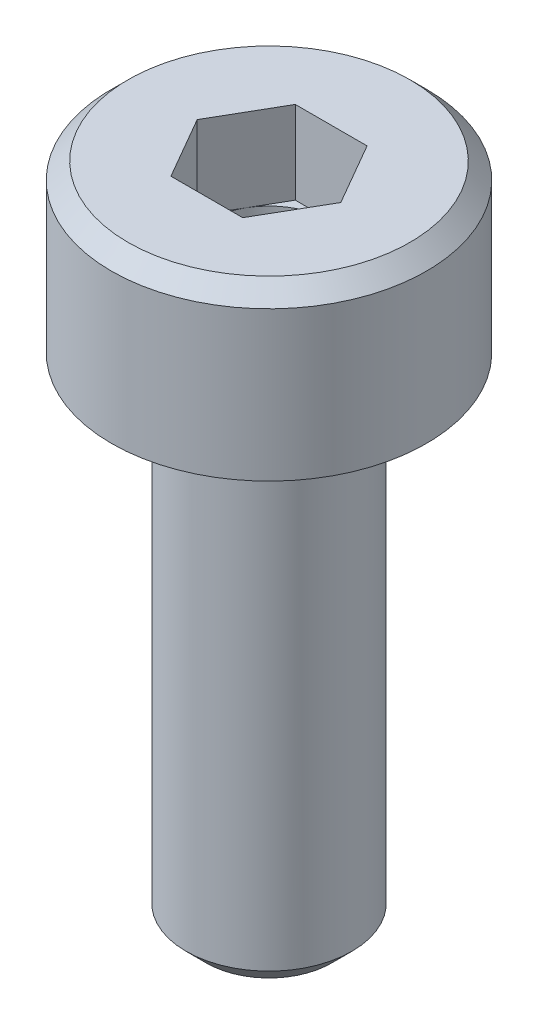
ISO-10303-21;
HEADER;
FILE_DESCRIPTION(('STEP AP214'),'2;1');
FILE_NAME('part.step','',(''),(''),'','','');
FILE_SCHEMA(('AUTOMOTIVE_DESIGN { 1 0 10303 214 1 1 1 1 }'));
ENDSEC;
DATA;
#1=APPLICATION_CONTEXT('core data for automotive mechanical design processes');
#2=APPLICATION_PROTOCOL_DEFINITION('international standard','automotive_design',2000,#1);
#3=PRODUCT_CONTEXT('',#1,'mechanical');
#4=PRODUCT('Part','Part','',(#3));
#5=PRODUCT_RELATED_PRODUCT_CATEGORY('part','',(#4));
#6=PRODUCT_DEFINITION_FORMATION('','',#4);
#7=PRODUCT_DEFINITION_CONTEXT('part definition',#1,'design');
#8=PRODUCT_DEFINITION('design','',#6,#7);
#9=PRODUCT_DEFINITION_SHAPE('','',#8);
#10=(LENGTH_UNIT() NAMED_UNIT(*) SI_UNIT(.MILLI.,.METRE.));
#11=(NAMED_UNIT(*) PLANE_ANGLE_UNIT() SI_UNIT($,.RADIAN.));
#12=(NAMED_UNIT(*) SI_UNIT($,.STERADIAN.) SOLID_ANGLE_UNIT());
#13=UNCERTAINTY_MEASURE_WITH_UNIT(LENGTH_MEASURE(1.E-05),#10,'distance_accuracy_value','');
#14=(GEOMETRIC_REPRESENTATION_CONTEXT(3) GLOBAL_UNCERTAINTY_ASSIGNED_CONTEXT((#13)) GLOBAL_UNIT_ASSIGNED_CONTEXT((#10,
#11,#12)) REPRESENTATION_CONTEXT('',''));
#15=CARTESIAN_POINT('',(0.,0.,0.));
#16=DIRECTION('',(0.,0.,1.));
#17=DIRECTION('',(1.,0.,0.));
#18=AXIS2_PLACEMENT_3D('',#15,#16,#17);
#19=CARTESIAN_POINT('',(0.,0.550000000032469,0.));
#20=DIRECTION('',(0.,1.,0.));
#21=DIRECTION('',(0.,0.,1.));
#22=AXIS2_PLACEMENT_3D('',#19,#20,#21);
#23=CONICAL_SURFACE('',#22,0.750000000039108,1.04719755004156);
#24=CARTESIAN_POINT('',(0.,0.116987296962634,0.));
#25=VERTEX_POINT('',#24);
#26=VERTEX_LOOP('',#25);
#27=FACE_BOUND('',#26,.T.);
#28=CARTESIAN_POINT('',(0.,0.55,0.));
#29=DIRECTION('',(0.,-1.,0.));
#30=DIRECTION('',(0.,0.,-1.));
#31=AXIS2_PLACEMENT_3D('',#28,#29,#30);
#32=CIRCLE('',#31,0.75);
#33=CARTESIAN_POINT('',(0.,0.55,-0.75));
#34=VERTEX_POINT('',#33);
#35=EDGE_CURVE('E98',#34,#34,#32,.F.);
#36=ORIENTED_EDGE('',*,*,#35,.T.);
#37=EDGE_LOOP('',(#36));
#38=FACE_BOUND('',#37,.T.);
#39=ADVANCED_FACE('F16',(#27,#38),#23,.F.);
#40=CARTESIAN_POINT('',(0.,2.,0.));
#41=DIRECTION('',(0.,-1.,0.));
#42=DIRECTION('',(0.,0.,-1.));
#43=AXIS2_PLACEMENT_3D('',#40,#41,#42);
#44=CYLINDRICAL_SURFACE('',#43,0.75);
#45=CARTESIAN_POINT('',(0.,1.,0.));
#46=DIRECTION('',(0.,-1.,0.));
#47=DIRECTION('',(0.,0.,-1.));
#48=AXIS2_PLACEMENT_3D('',#45,#46,#47);
#49=CIRCLE('',#48,0.75);
#50=CARTESIAN_POINT('',(0.,1.,-0.75));
#51=VERTEX_POINT('',#50);
#52=CARTESIAN_POINT('',(-0.649519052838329,1.,-0.375));
#53=VERTEX_POINT('',#52);
#54=EDGE_CURVE('E19',#51,#53,#49,.F.);
#55=ORIENTED_EDGE('',*,*,#54,.T.);
#56=CARTESIAN_POINT('',(0.,1.,0.));
#57=DIRECTION('',(0.,-1.,0.));
#58=DIRECTION('',(0.,0.,-1.));
#59=AXIS2_PLACEMENT_3D('',#56,#57,#58);
#60=CIRCLE('',#59,0.75);
#61=CARTESIAN_POINT('',(-0.649519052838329,1.,0.375));
#62=VERTEX_POINT('',#61);
#63=EDGE_CURVE('E93',#53,#62,#60,.F.);
#64=ORIENTED_EDGE('',*,*,#63,.T.);
#65=CARTESIAN_POINT('',(0.,1.,0.));
#66=DIRECTION('',(0.,-1.,0.));
#67=DIRECTION('',(0.,0.,-1.));
#68=AXIS2_PLACEMENT_3D('',#65,#66,#67);
#69=CIRCLE('',#68,0.75);
#70=CARTESIAN_POINT('',(0.,1.,0.75));
#71=VERTEX_POINT('',#70);
#72=EDGE_CURVE('E108',#62,#71,#69,.F.);
#73=ORIENTED_EDGE('',*,*,#72,.T.);
#74=CARTESIAN_POINT('',(0.,1.,0.));
#75=DIRECTION('',(0.,-1.,0.));
#76=DIRECTION('',(0.,0.,-1.));
#77=AXIS2_PLACEMENT_3D('',#74,#75,#76);
#78=CIRCLE('',#77,0.75);
#79=CARTESIAN_POINT('',(0.649519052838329,1.,0.375));
#80=VERTEX_POINT('',#79);
#81=EDGE_CURVE('E217',#71,#80,#78,.F.);
#82=ORIENTED_EDGE('',*,*,#81,.T.);
#83=CARTESIAN_POINT('',(0.,1.,0.));
#84=DIRECTION('',(0.,-1.,0.));
#85=DIRECTION('',(0.,0.,-1.));
#86=AXIS2_PLACEMENT_3D('',#83,#84,#85);
#87=CIRCLE('',#86,0.75);
#88=CARTESIAN_POINT('',(0.649519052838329,1.,-0.375));
#89=VERTEX_POINT('',#88);
#90=EDGE_CURVE('E219',#80,#89,#87,.F.);
#91=ORIENTED_EDGE('',*,*,#90,.T.);
#92=CARTESIAN_POINT('',(0.,1.,0.));
#93=DIRECTION('',(0.,-1.,0.));
#94=DIRECTION('',(0.,0.,-1.));
#95=AXIS2_PLACEMENT_3D('',#92,#93,#94);
#96=CIRCLE('',#95,0.75);
#97=EDGE_CURVE('E88',#89,#51,#96,.F.);
#98=ORIENTED_EDGE('',*,*,#97,.T.);
#99=EDGE_LOOP('',(#55,#64,#73,#82,#91,#98));
#100=FACE_BOUND('',#99,.T.);
#101=ORIENTED_EDGE('',*,*,#35,.F.);
#102=EDGE_LOOP('',(#101));
#103=FACE_BOUND('',#102,.T.);
#104=ADVANCED_FACE('F91',(#100,#103),#44,.F.);
#105=CARTESIAN_POINT('',(0.,1.,0.));
#106=DIRECTION('',(0.,-1.,0.));
#107=DIRECTION('',(0.,0.,-1.));
#108=AXIS2_PLACEMENT_3D('',#105,#106,#107);
#109=PLANE('',#108);
#110=DIRECTION('',(-0.5,0.,0.866025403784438));
#111=VECTOR('',#110,1.);
#112=CARTESIAN_POINT('',(-0.649519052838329,1.,-0.375));
#113=LINE('',#112,#111);
#114=CARTESIAN_POINT('',(-0.433012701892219,1.,-0.75));
#115=VERTEX_POINT('',#114);
#116=EDGE_CURVE('E111',#115,#53,#113,.T.);
#117=ORIENTED_EDGE('',*,*,#116,.T.);
#118=ORIENTED_EDGE('',*,*,#54,.F.);
#119=DIRECTION('',(-1.,0.,0.));
#120=VECTOR('',#119,1.);
#121=CARTESIAN_POINT('',(0.,1.,-0.75));
#122=LINE('',#121,#120);
#123=EDGE_CURVE('E114',#51,#115,#122,.T.);
#124=ORIENTED_EDGE('',*,*,#123,.T.);
#125=EDGE_LOOP('',(#117,#118,#124));
#126=FACE_BOUND('',#125,.T.);
#127=ADVANCED_FACE('F112',(#126),#109,.F.);
#128=CARTESIAN_POINT('',(0.,1.,0.));
#129=DIRECTION('',(0.,-1.,0.));
#130=DIRECTION('',(0.,0.,-1.));
#131=AXIS2_PLACEMENT_3D('',#128,#129,#130);
#132=PLANE('',#131);
#133=DIRECTION('',(-1.,0.,0.));
#134=VECTOR('',#133,1.);
#135=CARTESIAN_POINT('',(0.,1.,-0.75));
#136=LINE('',#135,#134);
#137=CARTESIAN_POINT('',(0.43301270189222,1.,-0.75));
#138=VERTEX_POINT('',#137);
#139=EDGE_CURVE('E183',#138,#51,#136,.T.);
#140=ORIENTED_EDGE('',*,*,#139,.T.);
#141=ORIENTED_EDGE('',*,*,#97,.F.);
#142=DIRECTION('',(0.5,0.,0.866025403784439));
#143=VECTOR('',#142,1.);
#144=CARTESIAN_POINT('',(0.649519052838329,1.,-0.375));
#145=LINE('',#144,#143);
#146=EDGE_CURVE('E174',#138,#89,#145,.T.);
#147=ORIENTED_EDGE('',*,*,#146,.F.);
#148=EDGE_LOOP('',(#140,#141,#147));
#149=FACE_BOUND('',#148,.T.);
#150=ADVANCED_FACE('F226',(#149),#132,.F.);
#151=CARTESIAN_POINT('',(0.,1.,0.));
#152=DIRECTION('',(0.,-1.,0.));
#153=DIRECTION('',(0.,0.,-1.));
#154=AXIS2_PLACEMENT_3D('',#151,#152,#153);
#155=PLANE('',#154);
#156=DIRECTION('',(0.5,0.,0.866025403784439));
#157=VECTOR('',#156,1.);
#158=CARTESIAN_POINT('',(0.649519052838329,1.,-0.375));
#159=LINE('',#158,#157);
#160=CARTESIAN_POINT('',(0.866025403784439,1.,0.));
#161=VERTEX_POINT('',#160);
#162=EDGE_CURVE('E171',#89,#161,#159,.T.);
#163=ORIENTED_EDGE('',*,*,#162,.F.);
#164=ORIENTED_EDGE('',*,*,#90,.F.);
#165=DIRECTION('',(-0.5,0.,0.866025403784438));
#166=VECTOR('',#165,1.);
#167=CARTESIAN_POINT('',(0.649519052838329,1.,0.375));
#168=LINE('',#167,#166);
#169=EDGE_CURVE('E159',#161,#80,#168,.T.);
#170=ORIENTED_EDGE('',*,*,#169,.F.);
#171=EDGE_LOOP('',(#163,#164,#170));
#172=FACE_BOUND('',#171,.T.);
#173=ADVANCED_FACE('F228',(#172),#155,.F.);
#174=CARTESIAN_POINT('',(0.,1.,0.));
#175=DIRECTION('',(0.,-1.,0.));
#176=DIRECTION('',(0.,0.,-1.));
#177=AXIS2_PLACEMENT_3D('',#174,#175,#176);
#178=PLANE('',#177);
#179=DIRECTION('',(-0.5,0.,0.866025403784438));
#180=VECTOR('',#179,1.);
#181=CARTESIAN_POINT('',(0.649519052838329,1.,0.375));
#182=LINE('',#181,#180);
#183=CARTESIAN_POINT('',(0.433012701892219,1.,0.75));
#184=VERTEX_POINT('',#183);
#185=EDGE_CURVE('E156',#80,#184,#182,.T.);
#186=ORIENTED_EDGE('',*,*,#185,.F.);
#187=ORIENTED_EDGE('',*,*,#81,.F.);
#188=DIRECTION('',(-1.,0.,0.));
#189=VECTOR('',#188,1.);
#190=CARTESIAN_POINT('',(0.,1.,0.75));
#191=LINE('',#190,#189);
#192=EDGE_CURVE('E144',#184,#71,#191,.T.);
#193=ORIENTED_EDGE('',*,*,#192,.F.);
#194=EDGE_LOOP('',(#186,#187,#193));
#195=FACE_BOUND('',#194,.T.);
#196=ADVANCED_FACE('F265',(#195),#178,.F.);
#197=CARTESIAN_POINT('',(0.,1.,0.));
#198=DIRECTION('',(0.,-1.,0.));
#199=DIRECTION('',(0.,0.,-1.));
#200=AXIS2_PLACEMENT_3D('',#197,#198,#199);
#201=PLANE('',#200);
#202=DIRECTION('',(-1.,0.,0.));
#203=VECTOR('',#202,1.);
#204=CARTESIAN_POINT('',(0.,1.,0.75));
#205=LINE('',#204,#203);
#206=CARTESIAN_POINT('',(-0.433012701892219,1.,0.75));
#207=VERTEX_POINT('',#206);
#208=EDGE_CURVE('E141',#71,#207,#205,.T.);
#209=ORIENTED_EDGE('',*,*,#208,.F.);
#210=ORIENTED_EDGE('',*,*,#72,.F.);
#211=DIRECTION('',(0.5,0.,0.866025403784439));
#212=VECTOR('',#211,1.);
#213=CARTESIAN_POINT('',(-0.649519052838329,1.,0.375));
#214=LINE('',#213,#212);
#215=EDGE_CURVE('E148',#62,#207,#214,.T.);
#216=ORIENTED_EDGE('',*,*,#215,.T.);
#217=EDGE_LOOP('',(#209,#210,#216));
#218=FACE_BOUND('',#217,.T.);
#219=ADVANCED_FACE('F262',(#218),#201,.F.);
#220=CARTESIAN_POINT('',(0.,1.,0.));
#221=DIRECTION('',(0.,-1.,0.));
#222=DIRECTION('',(0.,0.,-1.));
#223=AXIS2_PLACEMENT_3D('',#220,#221,#222);
#224=PLANE('',#223);
#225=DIRECTION('',(0.5,0.,0.866025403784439));
#226=VECTOR('',#225,1.);
#227=CARTESIAN_POINT('',(-0.649519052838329,1.,0.375));
#228=LINE('',#227,#226);
#229=CARTESIAN_POINT('',(-0.866025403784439,1.,0.));
#230=VERTEX_POINT('',#229);
#231=EDGE_CURVE('E106',#230,#62,#228,.T.);
#232=ORIENTED_EDGE('',*,*,#231,.T.);
#233=ORIENTED_EDGE('',*,*,#63,.F.);
#234=DIRECTION('',(-0.5,0.,0.866025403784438));
#235=VECTOR('',#234,1.);
#236=CARTESIAN_POINT('',(-0.649519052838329,1.,-0.375));
#237=LINE('',#236,#235);
#238=EDGE_CURVE('E103',#53,#230,#237,.T.);
#239=ORIENTED_EDGE('',*,*,#238,.T.);
#240=EDGE_LOOP('',(#232,#233,#239));
#241=FACE_BOUND('',#240,.T.);
#242=ADVANCED_FACE('F101',(#241),#224,.F.);
#243=CARTESIAN_POINT('',(-0.649519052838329,1.5,-0.375));
#244=DIRECTION('',(-0.866025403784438,0.,-0.5));
#245=DIRECTION('',(-0.5,0.,0.866025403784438));
#246=AXIS2_PLACEMENT_3D('',#243,#244,#245);
#247=PLANE('',#246);
#248=DIRECTION('',(0.,1.,0.));
#249=VECTOR('',#248,1.);
#250=CARTESIAN_POINT('',(-0.433012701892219,2.,-0.75));
#251=LINE('',#250,#249);
#252=CARTESIAN_POINT('',(-0.433012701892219,2.,-0.75));
#253=VERTEX_POINT('',#252);
#254=EDGE_CURVE('E187',#115,#253,#251,.T.);
#255=ORIENTED_EDGE('',*,*,#254,.T.);
#256=DIRECTION('',(0.500000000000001,0.,-0.866025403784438));
#257=VECTOR('',#256,1.);
#258=CARTESIAN_POINT('',(-0.866025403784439,2.,0.));
#259=LINE('',#258,#257);
#260=CARTESIAN_POINT('',(-0.866025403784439,2.,0.));
#261=VERTEX_POINT('',#260);
#262=EDGE_CURVE('E128',#261,#253,#259,.T.);
#263=ORIENTED_EDGE('',*,*,#262,.F.);
#264=DIRECTION('',(0.,1.,0.));
#265=VECTOR('',#264,1.);
#266=CARTESIAN_POINT('',(-0.866025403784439,1.5,0.));
#267=LINE('',#266,#265);
#268=EDGE_CURVE('E120',#261,#230,#267,.F.);
#269=ORIENTED_EDGE('',*,*,#268,.T.);
#270=ORIENTED_EDGE('',*,*,#238,.F.);
#271=ORIENTED_EDGE('',*,*,#116,.F.);
#272=EDGE_LOOP('',(#255,#263,#269,#270,#271));
#273=FACE_BOUND('',#272,.T.);
#274=ADVANCED_FACE('F118',(#273),#247,.F.);
#275=CARTESIAN_POINT('',(0.,2.,-0.75));
#276=DIRECTION('',(0.,0.,-1.));
#277=DIRECTION('',(-1.,0.,0.));
#278=AXIS2_PLACEMENT_3D('',#275,#276,#277);
#279=PLANE('',#278);
#280=DIRECTION('',(0.,1.,0.));
#281=VECTOR('',#280,1.);
#282=CARTESIAN_POINT('',(0.43301270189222,1.5,-0.75));
#283=LINE('',#282,#281);
#284=CARTESIAN_POINT('',(0.43301270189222,2.,-0.75));
#285=VERTEX_POINT('',#284);
#286=EDGE_CURVE('E168',#285,#138,#283,.F.);
#287=ORIENTED_EDGE('',*,*,#286,.F.);
#288=DIRECTION('',(1.,0.,0.));
#289=VECTOR('',#288,1.);
#290=CARTESIAN_POINT('',(0.,2.,-0.75));
#291=LINE('',#290,#289);
#292=EDGE_CURVE('E131',#253,#285,#291,.T.);
#293=ORIENTED_EDGE('',*,*,#292,.F.);
#294=ORIENTED_EDGE('',*,*,#254,.F.);
#295=ORIENTED_EDGE('',*,*,#123,.F.);
#296=ORIENTED_EDGE('',*,*,#139,.F.);
#297=EDGE_LOOP('',(#287,#293,#294,#295,#296));
#298=FACE_BOUND('',#297,.T.);
#299=ADVANCED_FACE('F237',(#298),#279,.F.);
#300=CARTESIAN_POINT('',(0.649519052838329,1.5,-0.375));
#301=DIRECTION('',(-0.866025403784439,0.,0.5));
#302=DIRECTION('',(0.5,0.,0.866025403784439));
#303=AXIS2_PLACEMENT_3D('',#300,#301,#302);
#304=PLANE('',#303);
#305=DIRECTION('',(0.5,0.,0.866025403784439));
#306=VECTOR('',#305,1.);
#307=CARTESIAN_POINT('',(0.43301270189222,2.,-0.75));
#308=LINE('',#307,#306);
#309=CARTESIAN_POINT('',(0.866025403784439,2.,0.));
#310=VERTEX_POINT('',#309);
#311=EDGE_CURVE('E233',#285,#310,#308,.T.);
#312=ORIENTED_EDGE('',*,*,#311,.F.);
#313=ORIENTED_EDGE('',*,*,#286,.T.);
#314=ORIENTED_EDGE('',*,*,#146,.T.);
#315=ORIENTED_EDGE('',*,*,#162,.T.);
#316=DIRECTION('',(0.,1.,0.));
#317=VECTOR('',#316,1.);
#318=CARTESIAN_POINT('',(0.866025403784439,1.5,0.));
#319=LINE('',#318,#317);
#320=EDGE_CURVE('E153',#310,#161,#319,.F.);
#321=ORIENTED_EDGE('',*,*,#320,.F.);
#322=EDGE_LOOP('',(#312,#313,#314,#315,#321));
#323=FACE_BOUND('',#322,.T.);
#324=ADVANCED_FACE('F231',(#323),#304,.T.);
#325=CARTESIAN_POINT('',(0.649519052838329,1.5,0.375));
#326=DIRECTION('',(-0.866025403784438,0.,-0.5));
#327=DIRECTION('',(-0.5,0.,0.866025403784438));
#328=AXIS2_PLACEMENT_3D('',#325,#326,#327);
#329=PLANE('',#328);
#330=DIRECTION('',(-0.500000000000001,0.,0.866025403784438));
#331=VECTOR('',#330,1.);
#332=CARTESIAN_POINT('',(0.866025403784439,2.,0.));
#333=LINE('',#332,#331);
#334=CARTESIAN_POINT('',(0.433012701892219,2.,0.75));
#335=VERTEX_POINT('',#334);
#336=EDGE_CURVE('E246',#310,#335,#333,.T.);
#337=ORIENTED_EDGE('',*,*,#336,.F.);
#338=ORIENTED_EDGE('',*,*,#320,.T.);
#339=ORIENTED_EDGE('',*,*,#169,.T.);
#340=ORIENTED_EDGE('',*,*,#185,.T.);
#341=DIRECTION('',(0.,1.,0.));
#342=VECTOR('',#341,1.);
#343=CARTESIAN_POINT('',(0.433012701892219,2.,0.75));
#344=LINE('',#343,#342);
#345=EDGE_CURVE('E143',#335,#184,#344,.F.);
#346=ORIENTED_EDGE('',*,*,#345,.F.);
#347=EDGE_LOOP('',(#337,#338,#339,#340,#346));
#348=FACE_BOUND('',#347,.T.);
#349=ADVANCED_FACE('F267',(#348),#329,.T.);
#350=CARTESIAN_POINT('',(0.,2.,0.75));
#351=DIRECTION('',(0.,0.,-1.));
#352=DIRECTION('',(-1.,0.,0.));
#353=AXIS2_PLACEMENT_3D('',#350,#351,#352);
#354=PLANE('',#353);
#355=DIRECTION('',(1.,0.,0.));
#356=VECTOR('',#355,1.);
#357=CARTESIAN_POINT('',(0.,2.,0.75));
#358=LINE('',#357,#356);
#359=CARTESIAN_POINT('',(-0.433012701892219,2.,0.75));
#360=VERTEX_POINT('',#359);
#361=EDGE_CURVE('E138',#335,#360,#358,.F.);
#362=ORIENTED_EDGE('',*,*,#361,.F.);
#363=ORIENTED_EDGE('',*,*,#345,.T.);
#364=ORIENTED_EDGE('',*,*,#192,.T.);
#365=ORIENTED_EDGE('',*,*,#208,.T.);
#366=DIRECTION('',(0.,1.,0.));
#367=VECTOR('',#366,1.);
#368=CARTESIAN_POINT('',(-0.433012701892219,1.5,0.75));
#369=LINE('',#368,#367);
#370=EDGE_CURVE('E34',#207,#360,#369,.T.);
#371=ORIENTED_EDGE('',*,*,#370,.T.);
#372=EDGE_LOOP('',(#362,#363,#364,#365,#371));
#373=FACE_BOUND('',#372,.T.);
#374=ADVANCED_FACE('F263',(#373),#354,.T.);
#375=CARTESIAN_POINT('',(-0.649519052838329,1.5,0.375));
#376=DIRECTION('',(-0.866025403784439,0.,0.5));
#377=DIRECTION('',(0.5,0.,0.866025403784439));
#378=AXIS2_PLACEMENT_3D('',#375,#376,#377);
#379=PLANE('',#378);
#380=ORIENTED_EDGE('',*,*,#268,.F.);
#381=DIRECTION('',(-0.500000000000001,0.,-0.866025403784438));
#382=VECTOR('',#381,1.);
#383=CARTESIAN_POINT('',(-0.433012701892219,2.,0.75));
#384=LINE('',#383,#382);
#385=EDGE_CURVE('E134',#360,#261,#384,.T.);
#386=ORIENTED_EDGE('',*,*,#385,.F.);
#387=ORIENTED_EDGE('',*,*,#370,.F.);
#388=ORIENTED_EDGE('',*,*,#215,.F.);
#389=ORIENTED_EDGE('',*,*,#231,.F.);
#390=EDGE_LOOP('',(#380,#386,#387,#388,#389));
#391=FACE_BOUND('',#390,.T.);
#392=ADVANCED_FACE('F240',(#391),#379,.F.);
#393=CARTESIAN_POINT('',(0.,2.,0.));
#394=DIRECTION('',(0.,1.,0.));
#395=DIRECTION('',(0.,0.,1.));
#396=AXIS2_PLACEMENT_3D('',#393,#394,#395);
#397=PLANE('',#396);
#398=ORIENTED_EDGE('',*,*,#361,.T.);
#399=ORIENTED_EDGE('',*,*,#385,.T.);
#400=ORIENTED_EDGE('',*,*,#262,.T.);
#401=ORIENTED_EDGE('',*,*,#292,.T.);
#402=ORIENTED_EDGE('',*,*,#311,.T.);
#403=ORIENTED_EDGE('',*,*,#336,.T.);
#404=EDGE_LOOP('',(#398,#399,#400,#401,#402,#403));
#405=FACE_BOUND('',#404,.T.);
#406=CARTESIAN_POINT('',(0.,2.00000000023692,0.));
#407=DIRECTION('',(0.,-1.,0.));
#408=DIRECTION('',(0.,0.,-1.));
#409=AXIS2_PLACEMENT_3D('',#406,#407,#408);
#410=CIRCLE('',#409,1.7000000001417);
#411=CARTESIAN_POINT('',(0.,2.00000000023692,-1.7000000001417));
#412=VERTEX_POINT('',#411);
#413=EDGE_CURVE('E137',#412,#412,#410,.T.);
#414=ORIENTED_EDGE('',*,*,#413,.F.);
#415=EDGE_LOOP('',(#414));
#416=FACE_BOUND('',#415,.T.);
#417=ADVANCED_FACE('F242',(#405,#416),#397,.T.);
#418=CARTESIAN_POINT('',(0.,1.80000000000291,0.));
#419=DIRECTION('',(0.,-1.,0.));
#420=DIRECTION('',(0.,0.,-1.));
#421=AXIS2_PLACEMENT_3D('',#418,#419,#420);
#422=CONICAL_SURFACE('',#421,1.90000000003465,0.785398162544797);
#423=CARTESIAN_POINT('',(0.,1.8,0.));
#424=DIRECTION('',(0.,1.,0.));
#425=DIRECTION('',(0.,0.,1.));
#426=AXIS2_PLACEMENT_3D('',#423,#424,#425);
#427=CIRCLE('',#426,1.9);
#428=CARTESIAN_POINT('',(0.,1.8,1.9));
#429=VERTEX_POINT('',#428);
#430=EDGE_CURVE('E213',#429,#429,#427,.F.);
#431=ORIENTED_EDGE('',*,*,#430,.F.);
#432=EDGE_LOOP('',(#431));
#433=FACE_BOUND('',#432,.T.);
#434=ORIENTED_EDGE('',*,*,#413,.T.);
#435=EDGE_LOOP('',(#434));
#436=FACE_BOUND('',#435,.T.);
#437=ADVANCED_FACE('F323',(#433,#436),#422,.T.);
#438=CARTESIAN_POINT('',(0.,0.,0.));
#439=DIRECTION('',(0.,1.,0.));
#440=DIRECTION('',(0.,0.,1.));
#441=AXIS2_PLACEMENT_3D('',#438,#439,#440);
#442=CYLINDRICAL_SURFACE('',#441,1.9);
#443=CARTESIAN_POINT('',(0.,0.,0.));
#444=DIRECTION('',(0.,1.,0.));
#445=DIRECTION('',(0.,0.,1.));
#446=AXIS2_PLACEMENT_3D('',#443,#444,#445);
#447=CIRCLE('',#446,1.9);
#448=CARTESIAN_POINT('',(0.,0.,1.9));
#449=VERTEX_POINT('',#448);
#450=EDGE_CURVE('E210',#449,#449,#447,.F.);
#451=ORIENTED_EDGE('',*,*,#450,.F.);
#452=EDGE_LOOP('',(#451));
#453=FACE_BOUND('',#452,.T.);
#454=ORIENTED_EDGE('',*,*,#430,.T.);
#455=EDGE_LOOP('',(#454));
#456=FACE_BOUND('',#455,.T.);
#457=ADVANCED_FACE('F319',(#453,#456),#442,.T.);
#458=CARTESIAN_POINT('',(0.,-6.,0.));
#459=DIRECTION('',(0.,-1.,0.));
#460=DIRECTION('',(0.,0.,-1.));
#461=AXIS2_PLACEMENT_3D('',#458,#459,#460);
#462=PLANE('',#461);
#463=CARTESIAN_POINT('',(0.,-5.99999999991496,0.));
#464=DIRECTION('',(0.,1.,0.));
#465=DIRECTION('',(0.,0.,1.));
#466=AXIS2_PLACEMENT_3D('',#463,#464,#465);
#467=CIRCLE('',#466,0.754620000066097);
#468=CARTESIAN_POINT('',(0.,-5.99999999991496,0.754620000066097));
#469=VERTEX_POINT('',#468);
#470=EDGE_CURVE('E206',#469,#469,#467,.T.);
#471=ORIENTED_EDGE('',*,*,#470,.F.);
#472=EDGE_LOOP('',(#471));
#473=FACE_BOUND('',#472,.T.);
#474=ADVANCED_FACE('F315',(#473),#462,.T.);
#475=CARTESIAN_POINT('',(0.,0.,0.));
#476=DIRECTION('',(0.,-1.,0.));
#477=DIRECTION('',(0.,0.,-1.));
#478=AXIS2_PLACEMENT_3D('',#475,#476,#477);
#479=PLANE('',#478);
#480=ORIENTED_EDGE('',*,*,#450,.T.);
#481=EDGE_LOOP('',(#480));
#482=FACE_BOUND('',#481,.T.);
#483=CARTESIAN_POINT('',(0.,0.,0.));
#484=DIRECTION('',(0.,-1.,0.));
#485=DIRECTION('',(0.,0.,-1.));
#486=AXIS2_PLACEMENT_3D('',#483,#484,#485);
#487=CIRCLE('',#486,1.1);
#488=CARTESIAN_POINT('',(0.,0.,-1.1));
#489=VERTEX_POINT('',#488);
#490=EDGE_CURVE('E209',#489,#489,#487,.F.);
#491=ORIENTED_EDGE('',*,*,#490,.T.);
#492=EDGE_LOOP('',(#491));
#493=FACE_BOUND('',#492,.T.);
#494=ADVANCED_FACE('F306',(#482,#493),#479,.T.);
#495=CARTESIAN_POINT('',(0.,-5.75461999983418,0.));
#496=DIRECTION('',(0.,1.,0.));
#497=DIRECTION('',(0.,0.,1.));
#498=AXIS2_PLACEMENT_3D('',#495,#496,#497);
#499=CONICAL_SURFACE('',#498,0.999999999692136,0.78539816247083);
#500=ORIENTED_EDGE('',*,*,#470,.T.);
#501=EDGE_LOOP('',(#500));
#502=FACE_BOUND('',#501,.T.);
#503=CARTESIAN_POINT('',(0.,-5.75462,0.));
#504=DIRECTION('',(0.,-1.,0.));
#505=DIRECTION('',(0.,0.,-1.));
#506=AXIS2_PLACEMENT_3D('',#503,#504,#505);
#507=CIRCLE('',#506,1.);
#508=CARTESIAN_POINT('',(0.,-5.75462,-1.));
#509=VERTEX_POINT('',#508);
#510=EDGE_CURVE('E25',#509,#509,#507,.F.);
#511=ORIENTED_EDGE('',*,*,#510,.F.);
#512=EDGE_LOOP('',(#511));
#513=FACE_BOUND('',#512,.T.);
#514=ADVANCED_FACE('F285',(#502,#513),#499,.T.);
#515=CARTESIAN_POINT('',(0.,-0.1,0.));
#516=DIRECTION('',(0.,-1.,0.));
#517=DIRECTION('',(0.,0.,1.));
#518=AXIS2_PLACEMENT_3D('',#515,#516,#517);
#519=TOROIDAL_SURFACE('',#518,1.1,0.1);
#520=CARTESIAN_POINT('',(0.,-0.1,0.));
#521=DIRECTION('',(0.,-1.,0.));
#522=DIRECTION('',(0.,0.,-1.));
#523=AXIS2_PLACEMENT_3D('',#520,#521,#522);
#524=CIRCLE('',#523,1.);
#525=CARTESIAN_POINT('',(0.,-0.1,-1.));
#526=VERTEX_POINT('',#525);
#527=EDGE_CURVE('E11',#526,#526,#524,.T.);
#528=ORIENTED_EDGE('',*,*,#527,.F.);
#529=EDGE_LOOP('',(#528));
#530=FACE_BOUND('',#529,.T.);
#531=ORIENTED_EDGE('',*,*,#490,.F.);
#532=EDGE_LOOP('',(#531));
#533=FACE_BOUND('',#532,.T.);
#534=ADVANCED_FACE('F279',(#530,#533),#519,.F.);
#535=CARTESIAN_POINT('',(0.,0.,0.));
#536=DIRECTION('',(0.,-1.,0.));
#537=DIRECTION('',(0.,0.,-1.));
#538=AXIS2_PLACEMENT_3D('',#535,#536,#537);
#539=CYLINDRICAL_SURFACE('',#538,1.);
#540=ORIENTED_EDGE('',*,*,#527,.T.);
#541=EDGE_LOOP('',(#540));
#542=FACE_BOUND('',#541,.T.);
#543=ORIENTED_EDGE('',*,*,#510,.T.);
#544=EDGE_LOOP('',(#543));
#545=FACE_BOUND('',#544,.T.);
#546=ADVANCED_FACE('F277',(#542,#545),#539,.T.);
#547=CLOSED_SHELL('',(#39,#104,#127,#150,#173,#196,#219,#242,#274,#299,#324,#349,#374,#392,#417,
#437,#457,#474,#494,#514,#534,#546));
#548=MANIFOLD_SOLID_BREP('B1',#547);
#549=ADVANCED_BREP_SHAPE_REPRESENTATION('',(#18,#548),#14);
#550=SHAPE_DEFINITION_REPRESENTATION(#9,#549);
ENDSEC;
END-ISO-10303-21;
